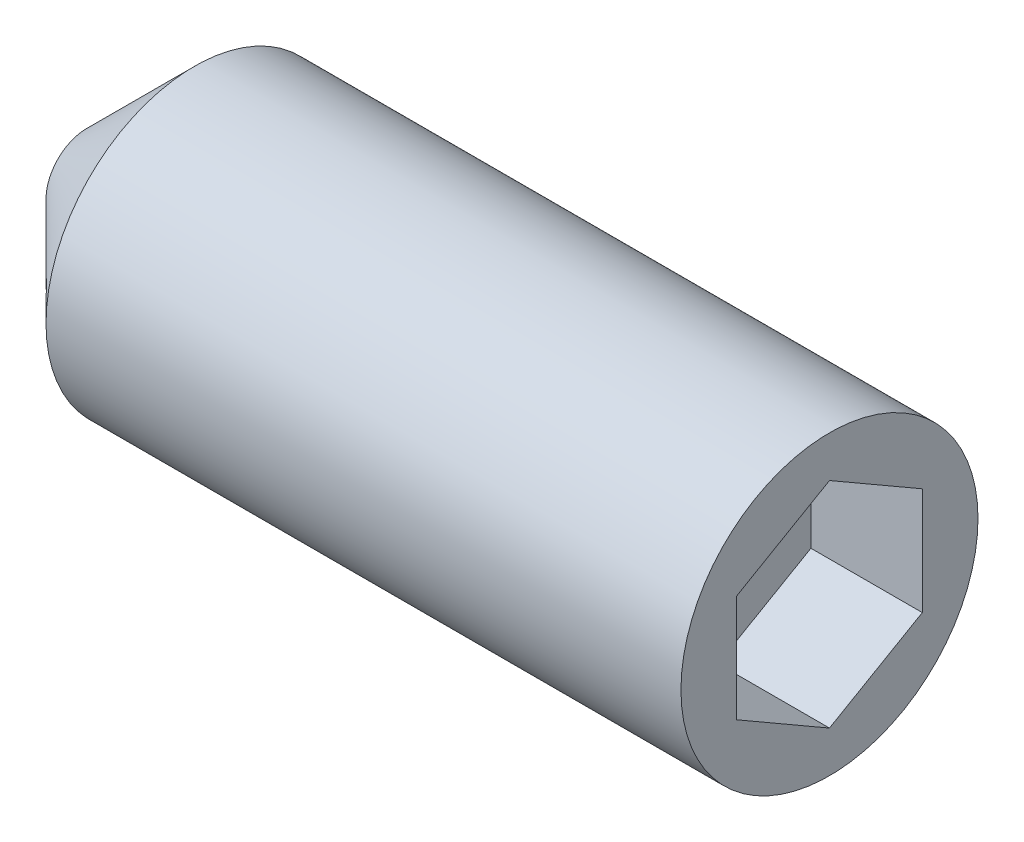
ISO-10303-21;
HEADER;
FILE_DESCRIPTION(('STEP AP214'),'2;1');
FILE_NAME('part.step','',(''),(''),'','','');
FILE_SCHEMA(('AUTOMOTIVE_DESIGN { 1 0 10303 214 1 1 1 1 }'));
ENDSEC;
DATA;
#1=APPLICATION_CONTEXT('core data for automotive mechanical design processes');
#2=APPLICATION_PROTOCOL_DEFINITION('international standard','automotive_design',2000,#1);
#3=PRODUCT_CONTEXT('',#1,'mechanical');
#4=PRODUCT('Part','Part','',(#3));
#5=PRODUCT_RELATED_PRODUCT_CATEGORY('part','',(#4));
#6=PRODUCT_DEFINITION_FORMATION('','',#4);
#7=PRODUCT_DEFINITION_CONTEXT('part definition',#1,'design');
#8=PRODUCT_DEFINITION('design','',#6,#7);
#9=PRODUCT_DEFINITION_SHAPE('','',#8);
#10=(LENGTH_UNIT() NAMED_UNIT(*) SI_UNIT(.MILLI.,.METRE.));
#11=(NAMED_UNIT(*) PLANE_ANGLE_UNIT() SI_UNIT($,.RADIAN.));
#12=(NAMED_UNIT(*) SI_UNIT($,.STERADIAN.) SOLID_ANGLE_UNIT());
#13=UNCERTAINTY_MEASURE_WITH_UNIT(LENGTH_MEASURE(1.E-05),#10,'distance_accuracy_value','');
#14=(GEOMETRIC_REPRESENTATION_CONTEXT(3) GLOBAL_UNCERTAINTY_ASSIGNED_CONTEXT((#13)) GLOBAL_UNIT_ASSIGNED_CONTEXT((#10,
#11,#12)) REPRESENTATION_CONTEXT('',''));
#15=CARTESIAN_POINT('',(0.,0.,0.));
#16=DIRECTION('',(0.,0.,1.));
#17=DIRECTION('',(1.,0.,0.));
#18=AXIS2_PLACEMENT_3D('',#15,#16,#17);
#19=CARTESIAN_POINT('',(0.,0.,0.));
#20=DIRECTION('',(-1.,0.,0.));
#21=DIRECTION('',(0.,0.,1.));
#22=AXIS2_PLACEMENT_3D('',#19,#20,#21);
#23=PLANE('',#22);
#24=CARTESIAN_POINT('',(0.,0.,0.));
#25=DIRECTION('',(1.,0.,0.));
#26=DIRECTION('',(0.,0.,-1.));
#27=AXIS2_PLACEMENT_3D('',#24,#25,#26);
#28=CIRCLE('',#27,1.1);
#29=CARTESIAN_POINT('',(0.,0.,-1.1));
#30=VERTEX_POINT('',#29);
#31=EDGE_CURVE('E11',#30,#30,#28,.T.);
#32=ORIENTED_EDGE('',*,*,#31,.F.);
#33=EDGE_LOOP('',(#32));
#34=FACE_BOUND('',#33,.T.);
#35=ADVANCED_FACE('F35',(#34),#23,.T.);
#36=CARTESIAN_POINT('',(2.90000000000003,0.,0.));
#37=DIRECTION('',(1.,0.,0.));
#38=DIRECTION('',(0.,0.,-1.));
#39=AXIS2_PLACEMENT_3D('',#36,#37,#38);
#40=CONICAL_SURFACE('',#39,4.,0.785398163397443);
#41=CARTESIAN_POINT('',(2.90000000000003,0.,0.));
#42=DIRECTION('',(1.,0.,0.));
#43=DIRECTION('',(0.,0.,-1.));
#44=AXIS2_PLACEMENT_3D('',#41,#42,#43);
#45=CIRCLE('',#44,4.);
#46=CARTESIAN_POINT('',(2.90000000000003,0.,-4.));
#47=VERTEX_POINT('',#46);
#48=EDGE_CURVE('E42',#47,#47,#45,.T.);
#49=CARTESIAN_POINT('',(0.,0.,-1.1));
#50=CARTESIAN_POINT('',(0.0302083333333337,0.,-1.13020833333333));
#51=CARTESIAN_POINT('',(0.0604166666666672,0.,-1.16041666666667));
#52=CARTESIAN_POINT('',(0.120833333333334,0.,-1.22083333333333));
#53=CARTESIAN_POINT('',(0.151041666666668,0.,-1.25104166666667));
#54=CARTESIAN_POINT('',(0.211458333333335,0.,-1.31145833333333));
#55=CARTESIAN_POINT('',(0.241666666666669,0.,-1.34166666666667));
#56=CARTESIAN_POINT('',(0.302083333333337,0.,-1.40208333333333));
#57=CARTESIAN_POINT('',(0.33229166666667,0.,-1.43229166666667));
#58=CARTESIAN_POINT('',(0.392708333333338,0.,-1.49270833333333));
#59=CARTESIAN_POINT('',(0.422916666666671,0.,-1.52291666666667));
#60=CARTESIAN_POINT('',(0.483333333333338,0.,-1.58333333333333));
#61=CARTESIAN_POINT('',(0.513541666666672,0.,-1.61354166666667));
#62=CARTESIAN_POINT('',(0.573958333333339,0.,-1.67395833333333));
#63=CARTESIAN_POINT('',(0.604166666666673,0.,-1.70416666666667));
#64=CARTESIAN_POINT('',(0.66458333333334,0.,-1.76458333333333));
#65=CARTESIAN_POINT('',(0.694791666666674,0.,-1.79479166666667));
#66=CARTESIAN_POINT('',(0.755208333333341,0.,-1.85520833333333));
#67=CARTESIAN_POINT('',(0.785416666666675,0.,-1.88541666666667));
#68=CARTESIAN_POINT('',(0.845833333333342,0.,-1.94583333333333));
#69=CARTESIAN_POINT('',(0.876041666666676,0.,-1.97604166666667));
#70=CARTESIAN_POINT('',(0.936458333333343,0.,-2.03645833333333));
#71=CARTESIAN_POINT('',(0.966666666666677,0.,-2.06666666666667));
#72=CARTESIAN_POINT('',(1.02708333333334,0.,-2.12708333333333));
#73=CARTESIAN_POINT('',(1.05729166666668,0.,-2.15729166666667));
#74=CARTESIAN_POINT('',(1.11770833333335,0.,-2.21770833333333));
#75=CARTESIAN_POINT('',(1.14791666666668,0.,-2.24791666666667));
#76=CARTESIAN_POINT('',(1.20833333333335,0.,-2.30833333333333));
#77=CARTESIAN_POINT('',(1.23854166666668,0.,-2.33854166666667));
#78=CARTESIAN_POINT('',(1.29895833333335,0.,-2.39895833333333));
#79=CARTESIAN_POINT('',(1.32916666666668,0.,-2.42916666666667));
#80=CARTESIAN_POINT('',(1.38958333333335,0.,-2.48958333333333));
#81=CARTESIAN_POINT('',(1.41979166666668,0.,-2.51979166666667));
#82=CARTESIAN_POINT('',(1.48020833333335,0.,-2.58020833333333));
#83=CARTESIAN_POINT('',(1.51041666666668,0.,-2.61041666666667));
#84=CARTESIAN_POINT('',(1.57083333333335,0.,-2.67083333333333));
#85=CARTESIAN_POINT('',(1.60104166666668,0.,-2.70104166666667));
#86=CARTESIAN_POINT('',(1.66145833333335,0.,-2.76145833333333));
#87=CARTESIAN_POINT('',(1.69166666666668,0.,-2.79166666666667));
#88=CARTESIAN_POINT('',(1.75208333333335,0.,-2.85208333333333));
#89=CARTESIAN_POINT('',(1.78229166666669,0.,-2.88229166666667));
#90=CARTESIAN_POINT('',(1.84270833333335,0.,-2.94270833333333));
#91=CARTESIAN_POINT('',(1.87291666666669,0.,-2.97291666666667));
#92=CARTESIAN_POINT('',(1.93333333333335,0.,-3.03333333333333));
#93=CARTESIAN_POINT('',(1.96354166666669,0.,-3.06354166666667));
#94=CARTESIAN_POINT('',(2.02395833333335,0.,-3.12395833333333));
#95=CARTESIAN_POINT('',(2.05416666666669,0.,-3.15416666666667));
#96=CARTESIAN_POINT('',(2.11458333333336,0.,-3.21458333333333));
#97=CARTESIAN_POINT('',(2.14479166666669,0.,-3.24479166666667));
#98=CARTESIAN_POINT('',(2.20520833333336,0.,-3.30520833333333));
#99=CARTESIAN_POINT('',(2.23541666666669,0.,-3.33541666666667));
#100=CARTESIAN_POINT('',(2.29583333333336,0.,-3.39583333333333));
#101=CARTESIAN_POINT('',(2.32604166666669,0.,-3.42604166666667));
#102=CARTESIAN_POINT('',(2.38645833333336,0.,-3.48645833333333));
#103=CARTESIAN_POINT('',(2.41666666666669,0.,-3.51666666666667));
#104=CARTESIAN_POINT('',(2.47708333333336,0.,-3.57708333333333));
#105=CARTESIAN_POINT('',(2.50729166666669,0.,-3.60729166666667));
#106=CARTESIAN_POINT('',(2.56770833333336,0.,-3.66770833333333));
#107=CARTESIAN_POINT('',(2.59791666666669,0.,-3.69791666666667));
#108=CARTESIAN_POINT('',(2.65833333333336,0.,-3.75833333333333));
#109=CARTESIAN_POINT('',(2.6885416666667,0.,-3.78854166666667));
#110=CARTESIAN_POINT('',(2.74895833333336,0.,-3.84895833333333));
#111=CARTESIAN_POINT('',(2.7791666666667,0.,-3.87916666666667));
#112=CARTESIAN_POINT('',(2.83958333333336,0.,-3.93958333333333));
#113=CARTESIAN_POINT('',(2.8697916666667,0.,-3.96979166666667));
#114=CARTESIAN_POINT('',(2.90000000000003,0.,-4.));
#115=B_SPLINE_CURVE_WITH_KNOTS('',3,(#49,#50,#51,#52,#53,#54,#55,#56,#57,#58,#59,#60,#61,#62,
#63,#64,#65,#66,#67,#68,#69,#70,#71,#72,#73,#74,#75,#76,#77,#78,#79,#80,#81,#82,#83,#84,#85,#86,
#87,#88,#89,#90,#91,#92,#93,#94,#95,#96,#97,#98,#99,#100,#101,#102,#103,#104,#105,#106,#107,
#108,#109,#110,#111,#112,#113,#114),.UNSPECIFIED.,.F.,.F.,(4,2,2,2,2,2,2,2,2,2,2,2,2,2,2,2,2,2,
2,2,2,2,2,2,2,2,2,2,2,2,2,2,4),(0.,0.128163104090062,0.256326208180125,0.384489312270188,
0.51265241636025,0.640815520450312,0.768978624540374,0.897141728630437,1.0253048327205,
1.15346793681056,1.28163104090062,1.40979414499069,1.53795724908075,1.66612035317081,
1.79428345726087,1.92244656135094,2.050609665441,2.17877276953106,2.30693587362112,
2.43509897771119,2.56326208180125,2.69142518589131,2.81958828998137,2.94775139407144,
3.0759144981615,3.20407760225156,3.33224070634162,3.46040381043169,3.58856691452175,
3.71673001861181,3.84489312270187,3.97305622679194,4.101219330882),.UNSPECIFIED.);
#116=EDGE_CURVE('BSEAM149',#30,#47,#115,.T.);
#117=ORIENTED_EDGE('',*,*,#31,.T.);
#118=ORIENTED_EDGE('',*,*,#48,.F.);
#119=ORIENTED_EDGE('',*,*,#116,.T.);
#120=ORIENTED_EDGE('',*,*,#116,.F.);
#121=EDGE_LOOP('',(#117,#119,#118,#120));
#122=FACE_BOUND('',#121,.T.);
#123=ADVANCED_FACE('F149',(#122),#40,.T.);
#124=CARTESIAN_POINT('',(20.,0.,0.));
#125=DIRECTION('',(1.,0.,0.));
#126=DIRECTION('',(0.,0.,-1.));
#127=AXIS2_PLACEMENT_3D('',#124,#125,#126);
#128=CYLINDRICAL_SURFACE('',#127,4.);
#129=ORIENTED_EDGE('',*,*,#48,.T.);
#130=EDGE_LOOP('',(#129));
#131=FACE_BOUND('',#130,.T.);
#132=CARTESIAN_POINT('',(20.,0.,0.));
#133=DIRECTION('',(1.,0.,0.));
#134=DIRECTION('',(0.,0.,-1.));
#135=AXIS2_PLACEMENT_3D('',#132,#133,#134);
#136=CIRCLE('',#135,4.);
#137=CARTESIAN_POINT('',(20.,0.,-4.));
#138=VERTEX_POINT('',#137);
#139=EDGE_CURVE('E136',#138,#138,#136,.T.);
#140=ORIENTED_EDGE('',*,*,#139,.F.);
#141=EDGE_LOOP('',(#140));
#142=FACE_BOUND('',#141,.T.);
#143=ADVANCED_FACE('F146',(#131,#142),#128,.T.);
#144=CARTESIAN_POINT('',(20.,4.,0.));
#145=DIRECTION('',(1.,0.,0.));
#146=DIRECTION('',(0.,0.,-1.));
#147=AXIS2_PLACEMENT_3D('',#144,#145,#146);
#148=PLANE('',#147);
#149=DIRECTION('',(0.,-1.,0.));
#150=VECTOR('',#149,1.);
#151=CARTESIAN_POINT('',(20.,1.44337567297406,2.5));
#152=LINE('',#151,#150);
#153=CARTESIAN_POINT('',(20.,1.44337567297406,2.5));
#154=VERTEX_POINT('',#153);
#155=CARTESIAN_POINT('',(20.,-1.44337567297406,2.5));
#156=VERTEX_POINT('',#155);
#157=EDGE_CURVE('E49',#154,#156,#152,.T.);
#158=ORIENTED_EDGE('',*,*,#157,.F.);
#159=DIRECTION('',(0.,-0.5,0.866025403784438));
#160=VECTOR('',#159,1.);
#161=CARTESIAN_POINT('',(20.,2.88675134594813,0.));
#162=LINE('',#161,#160);
#163=CARTESIAN_POINT('',(20.,2.88675134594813,0.));
#164=VERTEX_POINT('',#163);
#165=EDGE_CURVE('E132',#164,#154,#162,.T.);
#166=ORIENTED_EDGE('',*,*,#165,.F.);
#167=DIRECTION('',(0.,0.5,0.866025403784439));
#168=VECTOR('',#167,1.);
#169=CARTESIAN_POINT('',(20.,1.44337567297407,-2.5));
#170=LINE('',#169,#168);
#171=CARTESIAN_POINT('',(20.,1.44337567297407,-2.5));
#172=VERTEX_POINT('',#171);
#173=EDGE_CURVE('E130',#172,#164,#170,.T.);
#174=ORIENTED_EDGE('',*,*,#173,.F.);
#175=DIRECTION('',(0.,1.,0.));
#176=VECTOR('',#175,1.);
#177=CARTESIAN_POINT('',(20.,-1.44337567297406,-2.5));
#178=LINE('',#177,#176);
#179=CARTESIAN_POINT('',(20.,-1.44337567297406,-2.5));
#180=VERTEX_POINT('',#179);
#181=EDGE_CURVE('E97',#180,#172,#178,.T.);
#182=ORIENTED_EDGE('',*,*,#181,.F.);
#183=DIRECTION('',(0.,0.5,-0.866025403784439));
#184=VECTOR('',#183,1.);
#185=CARTESIAN_POINT('',(20.,-2.88675134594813,0.));
#186=LINE('',#185,#184);
#187=CARTESIAN_POINT('',(20.,-2.88675134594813,0.));
#188=VERTEX_POINT('',#187);
#189=EDGE_CURVE('E126',#188,#180,#186,.T.);
#190=ORIENTED_EDGE('',*,*,#189,.F.);
#191=DIRECTION('',(0.,-0.5,-0.866025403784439));
#192=VECTOR('',#191,1.);
#193=CARTESIAN_POINT('',(20.,-1.44337567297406,2.5));
#194=LINE('',#193,#192);
#195=EDGE_CURVE('E123',#156,#188,#194,.T.);
#196=ORIENTED_EDGE('',*,*,#195,.F.);
#197=EDGE_LOOP('',(#158,#166,#174,#182,#190,#196));
#198=FACE_BOUND('',#197,.T.);
#199=ORIENTED_EDGE('',*,*,#139,.T.);
#200=EDGE_LOOP('',(#199));
#201=FACE_BOUND('',#200,.T.);
#202=ADVANCED_FACE('F156',(#198,#201),#148,.T.);
#203=CARTESIAN_POINT('',(17.,1.44337567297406,2.5));
#204=DIRECTION('',(0.,0.,1.));
#205=DIRECTION('',(1.,0.,0.));
#206=AXIS2_PLACEMENT_3D('',#203,#204,#205);
#207=PLANE('',#206);
#208=ORIENTED_EDGE('',*,*,#157,.T.);
#209=DIRECTION('',(1.,0.,0.));
#210=VECTOR('',#209,1.);
#211=CARTESIAN_POINT('',(17.,-1.44337567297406,2.5));
#212=LINE('',#211,#210);
#213=CARTESIAN_POINT('',(17.,-1.44337567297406,2.5));
#214=VERTEX_POINT('',#213);
#215=EDGE_CURVE('E79',#214,#156,#212,.T.);
#216=ORIENTED_EDGE('',*,*,#215,.F.);
#217=DIRECTION('',(0.,-1.,0.));
#218=VECTOR('',#217,1.);
#219=CARTESIAN_POINT('',(17.,1.44337567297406,2.5));
#220=LINE('',#219,#218);
#221=CARTESIAN_POINT('',(17.,1.44337567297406,2.5));
#222=VERTEX_POINT('',#221);
#223=EDGE_CURVE('E134',#222,#214,#220,.T.);
#224=ORIENTED_EDGE('',*,*,#223,.F.);
#225=DIRECTION('',(1.,0.,0.));
#226=VECTOR('',#225,1.);
#227=CARTESIAN_POINT('',(17.,1.44337567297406,2.5));
#228=LINE('',#227,#226);
#229=EDGE_CURVE('E57',#222,#154,#228,.T.);
#230=ORIENTED_EDGE('',*,*,#229,.T.);
#231=EDGE_LOOP('',(#208,#216,#224,#230));
#232=FACE_BOUND('',#231,.T.);
#233=ADVANCED_FACE('F162',(#232),#207,.F.);
#234=CARTESIAN_POINT('',(17.,2.88675134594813,0.));
#235=DIRECTION('',(0.,0.866025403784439,0.5));
#236=DIRECTION('',(0.,-0.5,0.866025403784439));
#237=AXIS2_PLACEMENT_3D('',#234,#235,#236);
#238=PLANE('',#237);
#239=ORIENTED_EDGE('',*,*,#165,.T.);
#240=ORIENTED_EDGE('',*,*,#229,.F.);
#241=DIRECTION('',(0.,-0.5,0.866025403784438));
#242=VECTOR('',#241,1.);
#243=CARTESIAN_POINT('',(17.,2.88675134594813,0.));
#244=LINE('',#243,#242);
#245=CARTESIAN_POINT('',(17.,2.88675134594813,0.));
#246=VERTEX_POINT('',#245);
#247=EDGE_CURVE('E109',#246,#222,#244,.T.);
#248=ORIENTED_EDGE('',*,*,#247,.F.);
#249=DIRECTION('',(1.,0.,0.));
#250=VECTOR('',#249,1.);
#251=CARTESIAN_POINT('',(17.,2.88675134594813,0.));
#252=LINE('',#251,#250);
#253=EDGE_CURVE('E101',#246,#164,#252,.T.);
#254=ORIENTED_EDGE('',*,*,#253,.T.);
#255=EDGE_LOOP('',(#239,#240,#248,#254));
#256=FACE_BOUND('',#255,.T.);
#257=ADVANCED_FACE('F166',(#256),#238,.F.);
#258=CARTESIAN_POINT('',(17.,1.44337567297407,-2.5));
#259=DIRECTION('',(0.,0.866025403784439,-0.5));
#260=DIRECTION('',(0.,0.5,0.866025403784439));
#261=AXIS2_PLACEMENT_3D('',#258,#259,#260);
#262=PLANE('',#261);
#263=ORIENTED_EDGE('',*,*,#173,.T.);
#264=ORIENTED_EDGE('',*,*,#253,.F.);
#265=DIRECTION('',(0.,0.5,0.866025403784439));
#266=VECTOR('',#265,1.);
#267=CARTESIAN_POINT('',(17.,1.44337567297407,-2.5));
#268=LINE('',#267,#266);
#269=CARTESIAN_POINT('',(17.,1.44337567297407,-2.5));
#270=VERTEX_POINT('',#269);
#271=EDGE_CURVE('E105',#270,#246,#268,.T.);
#272=ORIENTED_EDGE('',*,*,#271,.F.);
#273=DIRECTION('',(1.,0.,0.));
#274=VECTOR('',#273,1.);
#275=CARTESIAN_POINT('',(17.,1.44337567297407,-2.5));
#276=LINE('',#275,#274);
#277=EDGE_CURVE('E90',#270,#172,#276,.T.);
#278=ORIENTED_EDGE('',*,*,#277,.T.);
#279=EDGE_LOOP('',(#263,#264,#272,#278));
#280=FACE_BOUND('',#279,.T.);
#281=ADVANCED_FACE('F106',(#280),#262,.F.);
#282=CARTESIAN_POINT('',(17.,-1.44337567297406,-2.5));
#283=DIRECTION('',(0.,0.,-1.));
#284=DIRECTION('',(-1.,0.,0.));
#285=AXIS2_PLACEMENT_3D('',#282,#283,#284);
#286=PLANE('',#285);
#287=ORIENTED_EDGE('',*,*,#181,.T.);
#288=ORIENTED_EDGE('',*,*,#277,.F.);
#289=DIRECTION('',(0.,1.,0.));
#290=VECTOR('',#289,1.);
#291=CARTESIAN_POINT('',(17.,-1.44337567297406,-2.5));
#292=LINE('',#291,#290);
#293=CARTESIAN_POINT('',(17.,-1.44337567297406,-2.5));
#294=VERTEX_POINT('',#293);
#295=EDGE_CURVE('E94',#294,#270,#292,.T.);
#296=ORIENTED_EDGE('',*,*,#295,.F.);
#297=DIRECTION('',(1.,0.,0.));
#298=VECTOR('',#297,1.);
#299=CARTESIAN_POINT('',(17.,-1.44337567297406,-2.5));
#300=LINE('',#299,#298);
#301=EDGE_CURVE('E102',#294,#180,#300,.T.);
#302=ORIENTED_EDGE('',*,*,#301,.T.);
#303=EDGE_LOOP('',(#287,#288,#296,#302));
#304=FACE_BOUND('',#303,.T.);
#305=ADVANCED_FACE('F92',(#304),#286,.F.);
#306=CARTESIAN_POINT('',(17.,-2.88675134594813,0.));
#307=DIRECTION('',(0.,-0.866025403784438,-0.5));
#308=DIRECTION('',(0.,0.5,-0.866025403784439));
#309=AXIS2_PLACEMENT_3D('',#306,#307,#308);
#310=PLANE('',#309);
#311=ORIENTED_EDGE('',*,*,#189,.T.);
#312=ORIENTED_EDGE('',*,*,#301,.F.);
#313=DIRECTION('',(0.,0.5,-0.866025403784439));
#314=VECTOR('',#313,1.);
#315=CARTESIAN_POINT('',(17.,-2.88675134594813,0.));
#316=LINE('',#315,#314);
#317=CARTESIAN_POINT('',(17.,-2.88675134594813,0.));
#318=VERTEX_POINT('',#317);
#319=EDGE_CURVE('E115',#318,#294,#316,.T.);
#320=ORIENTED_EDGE('',*,*,#319,.F.);
#321=DIRECTION('',(1.,0.,0.));
#322=VECTOR('',#321,1.);
#323=CARTESIAN_POINT('',(17.,-2.88675134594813,0.));
#324=LINE('',#323,#322);
#325=EDGE_CURVE('E139',#318,#188,#324,.T.);
#326=ORIENTED_EDGE('',*,*,#325,.T.);
#327=EDGE_LOOP('',(#311,#312,#320,#326));
#328=FACE_BOUND('',#327,.T.);
#329=ADVANCED_FACE('F170',(#328),#310,.F.);
#330=CARTESIAN_POINT('',(17.,-1.44337567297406,2.5));
#331=DIRECTION('',(0.,-0.866025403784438,0.5));
#332=DIRECTION('',(0.,-0.5,-0.866025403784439));
#333=AXIS2_PLACEMENT_3D('',#330,#331,#332);
#334=PLANE('',#333);
#335=ORIENTED_EDGE('',*,*,#195,.T.);
#336=ORIENTED_EDGE('',*,*,#325,.F.);
#337=DIRECTION('',(0.,-0.5,-0.866025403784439));
#338=VECTOR('',#337,1.);
#339=CARTESIAN_POINT('',(17.,-1.44337567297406,2.5));
#340=LINE('',#339,#338);
#341=EDGE_CURVE('E117',#214,#318,#340,.T.);
#342=ORIENTED_EDGE('',*,*,#341,.F.);
#343=ORIENTED_EDGE('',*,*,#215,.T.);
#344=EDGE_LOOP('',(#335,#336,#342,#343));
#345=FACE_BOUND('',#344,.T.);
#346=ADVANCED_FACE('F167',(#345),#334,.F.);
#347=CARTESIAN_POINT('',(17.,-1.44337567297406,2.5));
#348=DIRECTION('',(1.,0.,0.));
#349=DIRECTION('',(0.,0.,-1.));
#350=AXIS2_PLACEMENT_3D('',#347,#348,#349);
#351=PLANE('',#350);
#352=ORIENTED_EDGE('',*,*,#223,.T.);
#353=ORIENTED_EDGE('',*,*,#341,.T.);
#354=ORIENTED_EDGE('',*,*,#319,.T.);
#355=ORIENTED_EDGE('',*,*,#295,.T.);
#356=ORIENTED_EDGE('',*,*,#271,.T.);
#357=ORIENTED_EDGE('',*,*,#247,.T.);
#358=EDGE_LOOP('',(#352,#353,#354,#355,#356,#357));
#359=FACE_BOUND('',#358,.T.);
#360=ADVANCED_FACE('F112',(#359),#351,.T.);
#361=CLOSED_SHELL('',(#35,#123,#143,#202,#233,#257,#281,#305,#329,#346,#360));
#362=MANIFOLD_SOLID_BREP('B2',#361);
#363=ADVANCED_BREP_SHAPE_REPRESENTATION('',(#18,#362),#14);
#364=SHAPE_DEFINITION_REPRESENTATION(#9,#363);
ENDSEC;
END-ISO-10303-21;
